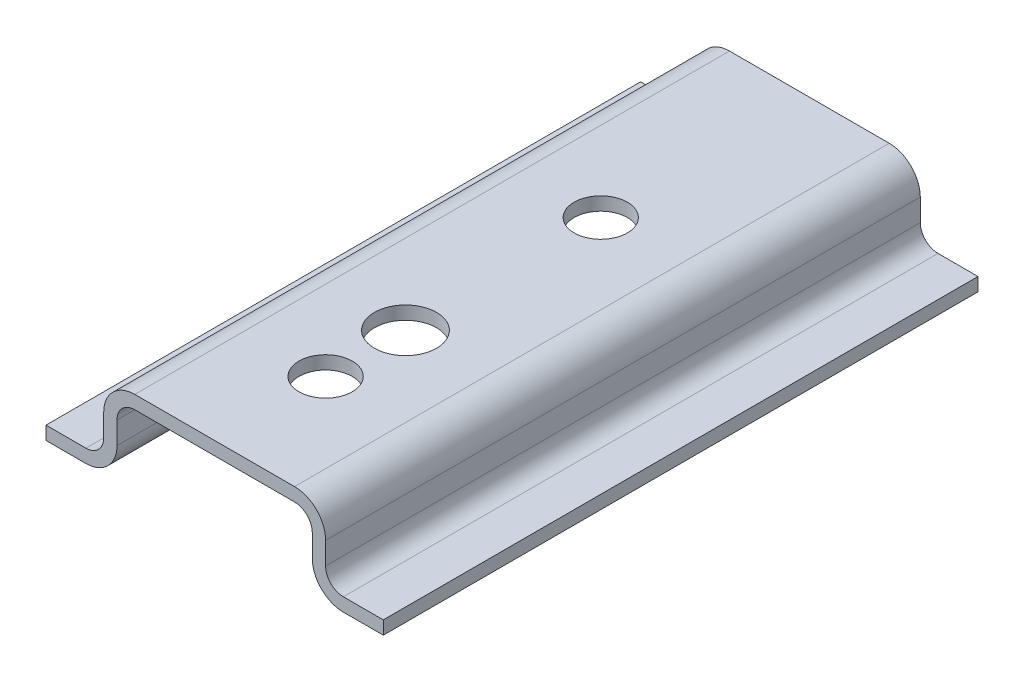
ISO-10303-21;
HEADER;
FILE_DESCRIPTION(('STEP AP214'),'2;1');
FILE_NAME('part.step','',(''),(''),'','','');
FILE_SCHEMA(('AUTOMOTIVE_DESIGN { 1 0 10303 214 1 1 1 1 }'));
ENDSEC;
DATA;
#1=APPLICATION_CONTEXT('core data for automotive mechanical design processes');
#2=APPLICATION_PROTOCOL_DEFINITION('international standard','automotive_design',2000,#1);
#3=PRODUCT_CONTEXT('',#1,'mechanical');
#4=PRODUCT('Part','Part','',(#3));
#5=PRODUCT_RELATED_PRODUCT_CATEGORY('part','',(#4));
#6=PRODUCT_DEFINITION_FORMATION('','',#4);
#7=PRODUCT_DEFINITION_CONTEXT('part definition',#1,'design');
#8=PRODUCT_DEFINITION('design','',#6,#7);
#9=PRODUCT_DEFINITION_SHAPE('','',#8);
#10=(LENGTH_UNIT() NAMED_UNIT(*) SI_UNIT(.MILLI.,.METRE.));
#11=(NAMED_UNIT(*) PLANE_ANGLE_UNIT() SI_UNIT($,.RADIAN.));
#12=(NAMED_UNIT(*) SI_UNIT($,.STERADIAN.) SOLID_ANGLE_UNIT());
#13=UNCERTAINTY_MEASURE_WITH_UNIT(LENGTH_MEASURE(1.E-05),#10,'distance_accuracy_value','');
#14=(GEOMETRIC_REPRESENTATION_CONTEXT(3) GLOBAL_UNCERTAINTY_ASSIGNED_CONTEXT((#13)) GLOBAL_UNIT_ASSIGNED_CONTEXT((#10,
#11,#12)) REPRESENTATION_CONTEXT('',''));
#15=CARTESIAN_POINT('',(0.,0.,0.));
#16=DIRECTION('',(0.,0.,1.));
#17=DIRECTION('',(1.,0.,0.));
#18=AXIS2_PLACEMENT_3D('',#15,#16,#17);
#19=CARTESIAN_POINT('',(-60.6550879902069,-32.7385166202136,134.));
#20=DIRECTION('',(0.,1.,0.));
#21=DIRECTION('',(0.,0.,1.));
#22=AXIS2_PLACEMENT_3D('',#19,#20,#21);
#23=PLANE('',#22);
#24=CARTESIAN_POINT('',(-42.6550879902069,-32.7385166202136,91.));
#25=DIRECTION('',(0.,1.,0.));
#26=DIRECTION('',(0.,0.,1.));
#27=AXIS2_PLACEMENT_3D('',#24,#25,#26);
#28=CIRCLE('',#27,7.);
#29=CARTESIAN_POINT('',(-42.6550879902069,-32.7385166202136,98.));
#30=VERTEX_POINT('',#29);
#31=EDGE_CURVE('E785',#30,#30,#28,.T.);
#32=ORIENTED_EDGE('',*,*,#31,.T.);
#33=EDGE_LOOP('',(#32));
#34=FACE_BOUND('',#33,.T.);
#35=CARTESIAN_POINT('',(-42.6550879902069,-32.7385166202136,109.));
#36=DIRECTION('',(0.,1.,0.));
#37=DIRECTION('',(0.,0.,1.));
#38=AXIS2_PLACEMENT_3D('',#35,#36,#37);
#39=CIRCLE('',#38,5.99999999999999);
#40=CARTESIAN_POINT('',(-42.6550879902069,-32.7385166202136,115.));
#41=VERTEX_POINT('',#40);
#42=EDGE_CURVE('E503',#41,#41,#39,.F.);
#43=ORIENTED_EDGE('',*,*,#42,.F.);
#44=EDGE_LOOP('',(#43));
#45=FACE_BOUND('',#44,.T.);
#46=DIRECTION('',(1.,0.,0.));
#47=VECTOR('',#46,1.);
#48=CARTESIAN_POINT('',(-60.6550879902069,-32.7385166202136,0.));
#49=LINE('',#48,#47);
#50=CARTESIAN_POINT('',(-60.6550879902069,-32.7385166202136,0.));
#51=VERTEX_POINT('',#50);
#52=CARTESIAN_POINT('',(-24.6550879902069,-32.7385166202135,0.));
#53=VERTEX_POINT('',#52);
#54=EDGE_CURVE('E515',#51,#53,#49,.T.);
#55=ORIENTED_EDGE('',*,*,#54,.T.);
#56=DIRECTION('',(0.,0.,-1.));
#57=VECTOR('',#56,1.);
#58=CARTESIAN_POINT('',(-24.6550879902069,-32.7385166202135,134.));
#59=LINE('',#58,#57);
#60=CARTESIAN_POINT('',(-24.6550879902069,-32.7385166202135,134.));
#61=VERTEX_POINT('',#60);
#62=EDGE_CURVE('E629',#61,#53,#59,.T.);
#63=ORIENTED_EDGE('',*,*,#62,.F.);
#64=DIRECTION('',(1.,0.,0.));
#65=VECTOR('',#64,1.);
#66=CARTESIAN_POINT('',(-60.6550879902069,-32.7385166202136,134.));
#67=LINE('',#66,#65);
#68=CARTESIAN_POINT('',(-60.6550879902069,-32.7385166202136,134.));
#69=VERTEX_POINT('',#68);
#70=EDGE_CURVE('E564',#69,#61,#67,.T.);
#71=ORIENTED_EDGE('',*,*,#70,.F.);
#72=DIRECTION('',(0.,0.,-1.));
#73=VECTOR('',#72,1.);
#74=CARTESIAN_POINT('',(-60.6550879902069,-32.7385166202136,134.));
#75=LINE('',#74,#73);
#76=EDGE_CURVE('E632',#69,#51,#75,.T.);
#77=ORIENTED_EDGE('',*,*,#76,.T.);
#78=EDGE_LOOP('',(#55,#63,#71,#77));
#79=FACE_BOUND('',#78,.T.);
#80=CARTESIAN_POINT('',(-42.6550879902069,-32.7385166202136,47.));
#81=DIRECTION('',(0.,1.,0.));
#82=DIRECTION('',(0.,0.,1.));
#83=AXIS2_PLACEMENT_3D('',#80,#81,#82);
#84=CIRCLE('',#83,5.99999999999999);
#85=CARTESIAN_POINT('',(-42.6550879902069,-32.7385166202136,53.));
#86=VERTEX_POINT('',#85);
#87=EDGE_CURVE('E789',#86,#86,#84,.F.);
#88=ORIENTED_EDGE('',*,*,#87,.F.);
#89=EDGE_LOOP('',(#88));
#90=FACE_BOUND('',#89,.T.);
#91=ADVANCED_FACE('F348',(#34,#45,#79,#90),#23,.F.);
#92=CARTESIAN_POINT('',(-60.6550879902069,-29.7385166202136,134.));
#93=DIRECTION('',(0.,1.,0.));
#94=DIRECTION('',(0.,0.,1.));
#95=AXIS2_PLACEMENT_3D('',#92,#93,#94);
#96=PLANE('',#95);
#97=CARTESIAN_POINT('',(-42.6550879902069,-29.7385166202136,91.));
#98=DIRECTION('',(0.,1.,0.));
#99=DIRECTION('',(0.,0.,1.));
#100=AXIS2_PLACEMENT_3D('',#97,#98,#99);
#101=CIRCLE('',#100,7.);
#102=CARTESIAN_POINT('',(-42.6550879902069,-29.7385166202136,98.));
#103=VERTEX_POINT('',#102);
#104=EDGE_CURVE('E783',#103,#103,#101,.T.);
#105=ORIENTED_EDGE('',*,*,#104,.F.);
#106=EDGE_LOOP('',(#105));
#107=FACE_BOUND('',#106,.T.);
#108=CARTESIAN_POINT('',(-42.6550879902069,-29.7385166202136,109.));
#109=DIRECTION('',(0.,1.,0.));
#110=DIRECTION('',(0.,0.,1.));
#111=AXIS2_PLACEMENT_3D('',#108,#109,#110);
#112=CIRCLE('',#111,5.99999999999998);
#113=CARTESIAN_POINT('',(-42.6550879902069,-29.7385166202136,115.));
#114=VERTEX_POINT('',#113);
#115=EDGE_CURVE('E506',#114,#114,#112,.T.);
#116=ORIENTED_EDGE('',*,*,#115,.F.);
#117=EDGE_LOOP('',(#116));
#118=FACE_BOUND('',#117,.T.);
#119=DIRECTION('',(1.,0.,0.));
#120=VECTOR('',#119,1.);
#121=CARTESIAN_POINT('',(-60.6550879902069,-29.7385166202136,0.));
#122=LINE('',#121,#120);
#123=CARTESIAN_POINT('',(-60.6550879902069,-29.7385166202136,0.));
#124=VERTEX_POINT('',#123);
#125=CARTESIAN_POINT('',(-24.6550879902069,-29.7385166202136,0.));
#126=VERTEX_POINT('',#125);
#127=EDGE_CURVE('E541',#124,#126,#122,.T.);
#128=ORIENTED_EDGE('',*,*,#127,.F.);
#129=DIRECTION('',(0.,0.,-1.));
#130=VECTOR('',#129,1.);
#131=CARTESIAN_POINT('',(-60.6550879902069,-29.7385166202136,134.));
#132=LINE('',#131,#130);
#133=CARTESIAN_POINT('',(-60.6550879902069,-29.7385166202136,134.));
#134=VERTEX_POINT('',#133);
#135=EDGE_CURVE('E606',#134,#124,#132,.T.);
#136=ORIENTED_EDGE('',*,*,#135,.F.);
#137=DIRECTION('',(1.,0.,0.));
#138=VECTOR('',#137,1.);
#139=CARTESIAN_POINT('',(-60.6550879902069,-29.7385166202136,134.));
#140=LINE('',#139,#138);
#141=CARTESIAN_POINT('',(-24.6550879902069,-29.7385166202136,134.));
#142=VERTEX_POINT('',#141);
#143=EDGE_CURVE('E587',#134,#142,#140,.T.);
#144=ORIENTED_EDGE('',*,*,#143,.T.);
#145=DIRECTION('',(0.,0.,-1.));
#146=VECTOR('',#145,1.);
#147=CARTESIAN_POINT('',(-24.6550879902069,-29.7385166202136,134.));
#148=LINE('',#147,#146);
#149=EDGE_CURVE('E608',#142,#126,#148,.T.);
#150=ORIENTED_EDGE('',*,*,#149,.T.);
#151=EDGE_LOOP('',(#128,#136,#144,#150));
#152=FACE_BOUND('',#151,.T.);
#153=CARTESIAN_POINT('',(-42.6550879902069,-29.7385166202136,47.));
#154=DIRECTION('',(0.,1.,0.));
#155=DIRECTION('',(0.,0.,1.));
#156=AXIS2_PLACEMENT_3D('',#153,#154,#155);
#157=CIRCLE('',#156,5.99999999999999);
#158=CARTESIAN_POINT('',(-42.6550879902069,-29.7385166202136,53.));
#159=VERTEX_POINT('',#158);
#160=EDGE_CURVE('E786',#159,#159,#157,.T.);
#161=ORIENTED_EDGE('',*,*,#160,.F.);
#162=EDGE_LOOP('',(#161));
#163=FACE_BOUND('',#162,.T.);
#164=ADVANCED_FACE('F662',(#107,#118,#152,#163),#96,.T.);
#165=CARTESIAN_POINT('',(-80.6550879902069,-45.7385166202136,134.));
#166=DIRECTION('',(1.,0.,0.));
#167=DIRECTION('',(0.,0.,-1.));
#168=AXIS2_PLACEMENT_3D('',#165,#166,#167);
#169=PLANE('',#168);
#170=DIRECTION('',(0.,-1.,0.));
#171=VECTOR('',#170,1.);
#172=CARTESIAN_POINT('',(-80.6550879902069,-45.7385166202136,0.));
#173=LINE('',#172,#171);
#174=CARTESIAN_POINT('',(-80.6550879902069,-45.7385166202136,0.));
#175=VERTEX_POINT('',#174);
#176=CARTESIAN_POINT('',(-80.6550879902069,-48.7385166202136,0.));
#177=VERTEX_POINT('',#176);
#178=EDGE_CURVE('E491',#175,#177,#173,.T.);
#179=ORIENTED_EDGE('',*,*,#178,.T.);
#180=DIRECTION('',(0.,0.,-1.));
#181=VECTOR('',#180,1.);
#182=CARTESIAN_POINT('',(-80.6550879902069,-48.7385166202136,134.));
#183=LINE('',#182,#181);
#184=CARTESIAN_POINT('',(-80.6550879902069,-48.7385166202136,134.));
#185=VERTEX_POINT('',#184);
#186=EDGE_CURVE('E11',#185,#177,#183,.T.);
#187=ORIENTED_EDGE('',*,*,#186,.F.);
#188=DIRECTION('',(0.,-1.,0.));
#189=VECTOR('',#188,1.);
#190=CARTESIAN_POINT('',(-80.6550879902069,-45.7385166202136,134.));
#191=LINE('',#190,#189);
#192=CARTESIAN_POINT('',(-80.6550879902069,-45.7385166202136,134.));
#193=VERTEX_POINT('',#192);
#194=EDGE_CURVE('E555',#193,#185,#191,.T.);
#195=ORIENTED_EDGE('',*,*,#194,.F.);
#196=DIRECTION('',(0.,0.,-1.));
#197=VECTOR('',#196,1.);
#198=CARTESIAN_POINT('',(-80.6550879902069,-45.7385166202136,134.));
#199=LINE('',#198,#197);
#200=EDGE_CURVE('E363',#193,#175,#199,.T.);
#201=ORIENTED_EDGE('',*,*,#200,.T.);
#202=EDGE_LOOP('',(#179,#187,#195,#201));
#203=FACE_BOUND('',#202,.T.);
#204=ADVANCED_FACE('F350',(#203),#169,.F.);
#205=CARTESIAN_POINT('',(-80.6550879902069,-48.7385166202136,134.));
#206=DIRECTION('',(0.,1.,0.));
#207=DIRECTION('',(0.,0.,1.));
#208=AXIS2_PLACEMENT_3D('',#205,#206,#207);
#209=PLANE('',#208);
#210=DIRECTION('',(1.,0.,0.));
#211=VECTOR('',#210,1.);
#212=CARTESIAN_POINT('',(-80.6550879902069,-48.7385166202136,0.));
#213=LINE('',#212,#211);
#214=CARTESIAN_POINT('',(-71.6550879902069,-48.7385166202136,0.));
#215=VERTEX_POINT('',#214);
#216=EDGE_CURVE('E487',#177,#215,#213,.T.);
#217=ORIENTED_EDGE('',*,*,#216,.T.);
#218=DIRECTION('',(0.,0.,-1.));
#219=VECTOR('',#218,1.);
#220=CARTESIAN_POINT('',(-71.6550879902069,-48.7385166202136,134.));
#221=LINE('',#220,#219);
#222=CARTESIAN_POINT('',(-71.6550879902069,-48.7385166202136,134.));
#223=VERTEX_POINT('',#222);
#224=EDGE_CURVE('E356',#223,#215,#221,.T.);
#225=ORIENTED_EDGE('',*,*,#224,.F.);
#226=DIRECTION('',(1.,0.,0.));
#227=VECTOR('',#226,1.);
#228=CARTESIAN_POINT('',(-80.6550879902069,-48.7385166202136,134.));
#229=LINE('',#228,#227);
#230=EDGE_CURVE('E500',#185,#223,#229,.T.);
#231=ORIENTED_EDGE('',*,*,#230,.F.);
#232=ORIENTED_EDGE('',*,*,#186,.T.);
#233=EDGE_LOOP('',(#217,#225,#231,#232));
#234=FACE_BOUND('',#233,.T.);
#235=ADVANCED_FACE('F499',(#234),#209,.F.);
#236=CARTESIAN_POINT('',(-71.6550879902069,-41.7385166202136,134.));
#237=DIRECTION('',(0.,0.,-1.));
#238=DIRECTION('',(-1.,0.,0.));
#239=AXIS2_PLACEMENT_3D('',#236,#237,#238);
#240=CYLINDRICAL_SURFACE('',#239,6.99999999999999);
#241=CARTESIAN_POINT('',(-71.6550879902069,-41.7385166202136,0.));
#242=DIRECTION('',(0.,0.,1.));
#243=DIRECTION('',(1.,0.,0.));
#244=AXIS2_PLACEMENT_3D('',#241,#242,#243);
#245=CIRCLE('',#244,6.99999999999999);
#246=CARTESIAN_POINT('',(-64.6550879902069,-41.7385166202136,0.));
#247=VERTEX_POINT('',#246);
#248=EDGE_CURVE('E493',#215,#247,#245,.T.);
#249=ORIENTED_EDGE('',*,*,#248,.T.);
#250=DIRECTION('',(0.,0.,-1.));
#251=VECTOR('',#250,1.);
#252=CARTESIAN_POINT('',(-64.6550879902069,-41.7385166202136,134.));
#253=LINE('',#252,#251);
#254=CARTESIAN_POINT('',(-64.6550879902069,-41.7385166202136,134.));
#255=VERTEX_POINT('',#254);
#256=EDGE_CURVE('E638',#255,#247,#253,.T.);
#257=ORIENTED_EDGE('',*,*,#256,.F.);
#258=CARTESIAN_POINT('',(-71.6550879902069,-41.7385166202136,134.));
#259=DIRECTION('',(0.,0.,1.));
#260=DIRECTION('',(1.,0.,0.));
#261=AXIS2_PLACEMENT_3D('',#258,#259,#260);
#262=CIRCLE('',#261,6.99999999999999);
#263=EDGE_CURVE('E558',#223,#255,#262,.T.);
#264=ORIENTED_EDGE('',*,*,#263,.F.);
#265=ORIENTED_EDGE('',*,*,#224,.T.);
#266=EDGE_LOOP('',(#249,#257,#264,#265));
#267=FACE_BOUND('',#266,.T.);
#268=ADVANCED_FACE('F642',(#267),#240,.T.);
#269=CARTESIAN_POINT('',(-64.6550879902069,-41.7385166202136,134.));
#270=DIRECTION('',(-1.,0.,0.));
#271=DIRECTION('',(0.,0.,1.));
#272=AXIS2_PLACEMENT_3D('',#269,#270,#271);
#273=PLANE('',#272);
#274=DIRECTION('',(0.,1.,0.));
#275=VECTOR('',#274,1.);
#276=CARTESIAN_POINT('',(-64.6550879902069,-41.7385166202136,0.));
#277=LINE('',#276,#275);
#278=CARTESIAN_POINT('',(-64.6550879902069,-36.7385166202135,0.));
#279=VERTEX_POINT('',#278);
#280=EDGE_CURVE('E511',#247,#279,#277,.T.);
#281=ORIENTED_EDGE('',*,*,#280,.T.);
#282=DIRECTION('',(0.,0.,-1.));
#283=VECTOR('',#282,1.);
#284=CARTESIAN_POINT('',(-64.6550879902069,-36.7385166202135,134.));
#285=LINE('',#284,#283);
#286=CARTESIAN_POINT('',(-64.6550879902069,-36.7385166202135,134.));
#287=VERTEX_POINT('',#286);
#288=EDGE_CURVE('E635',#287,#279,#285,.T.);
#289=ORIENTED_EDGE('',*,*,#288,.F.);
#290=DIRECTION('',(0.,1.,0.));
#291=VECTOR('',#290,1.);
#292=CARTESIAN_POINT('',(-64.6550879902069,-41.7385166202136,134.));
#293=LINE('',#292,#291);
#294=EDGE_CURVE('E560',#255,#287,#293,.T.);
#295=ORIENTED_EDGE('',*,*,#294,.F.);
#296=ORIENTED_EDGE('',*,*,#256,.T.);
#297=EDGE_LOOP('',(#281,#289,#295,#296));
#298=FACE_BOUND('',#297,.T.);
#299=ADVANCED_FACE('F716',(#298),#273,.F.);
#300=CARTESIAN_POINT('',(-60.6550879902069,-36.7385166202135,134.));
#301=DIRECTION('',(0.,0.,-1.));
#302=DIRECTION('',(-1.,0.,0.));
#303=AXIS2_PLACEMENT_3D('',#300,#301,#302);
#304=CYLINDRICAL_SURFACE('',#303,3.99999999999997);
#305=CARTESIAN_POINT('',(-60.6550879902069,-36.7385166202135,0.));
#306=DIRECTION('',(0.,0.,-1.));
#307=DIRECTION('',(-1.,0.,0.));
#308=AXIS2_PLACEMENT_3D('',#305,#306,#307);
#309=CIRCLE('',#308,3.99999999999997);
#310=EDGE_CURVE('E513',#279,#51,#309,.T.);
#311=ORIENTED_EDGE('',*,*,#310,.T.);
#312=ORIENTED_EDGE('',*,*,#76,.F.);
#313=CARTESIAN_POINT('',(-60.6550879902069,-36.7385166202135,134.));
#314=DIRECTION('',(0.,0.,-1.));
#315=DIRECTION('',(-1.,0.,0.));
#316=AXIS2_PLACEMENT_3D('',#313,#314,#315);
#317=CIRCLE('',#316,3.99999999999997);
#318=EDGE_CURVE('E562',#287,#69,#317,.T.);
#319=ORIENTED_EDGE('',*,*,#318,.F.);
#320=ORIENTED_EDGE('',*,*,#288,.T.);
#321=EDGE_LOOP('',(#311,#312,#319,#320));
#322=FACE_BOUND('',#321,.T.);
#323=ADVANCED_FACE('F714',(#322),#304,.F.);
#324=CARTESIAN_POINT('',(-24.6550879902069,-36.7385166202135,134.));
#325=DIRECTION('',(0.,0.,-1.));
#326=DIRECTION('',(-1.,0.,0.));
#327=AXIS2_PLACEMENT_3D('',#324,#325,#326);
#328=CYLINDRICAL_SURFACE('',#327,3.99999999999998);
#329=CARTESIAN_POINT('',(-24.6550879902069,-36.7385166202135,0.));
#330=DIRECTION('',(0.,0.,-1.));
#331=DIRECTION('',(-1.,0.,0.));
#332=AXIS2_PLACEMENT_3D('',#329,#330,#331);
#333=CIRCLE('',#332,3.99999999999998);
#334=CARTESIAN_POINT('',(-20.6550879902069,-36.7385166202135,0.));
#335=VERTEX_POINT('',#334);
#336=EDGE_CURVE('E517',#53,#335,#333,.T.);
#337=ORIENTED_EDGE('',*,*,#336,.T.);
#338=DIRECTION('',(0.,0.,-1.));
#339=VECTOR('',#338,1.);
#340=CARTESIAN_POINT('',(-20.6550879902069,-36.7385166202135,134.));
#341=LINE('',#340,#339);
#342=CARTESIAN_POINT('',(-20.6550879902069,-36.7385166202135,134.));
#343=VERTEX_POINT('',#342);
#344=EDGE_CURVE('E626',#343,#335,#341,.T.);
#345=ORIENTED_EDGE('',*,*,#344,.F.);
#346=CARTESIAN_POINT('',(-24.6550879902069,-36.7385166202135,134.));
#347=DIRECTION('',(0.,0.,-1.));
#348=DIRECTION('',(-1.,0.,0.));
#349=AXIS2_PLACEMENT_3D('',#346,#347,#348);
#350=CIRCLE('',#349,3.99999999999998);
#351=EDGE_CURVE('E566',#61,#343,#350,.T.);
#352=ORIENTED_EDGE('',*,*,#351,.F.);
#353=ORIENTED_EDGE('',*,*,#62,.T.);
#354=EDGE_LOOP('',(#337,#345,#352,#353));
#355=FACE_BOUND('',#354,.T.);
#356=ADVANCED_FACE('F705',(#355),#328,.F.);
#357=CARTESIAN_POINT('',(-20.6550879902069,-36.7385166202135,134.));
#358=DIRECTION('',(1.,0.,0.));
#359=DIRECTION('',(0.,0.,-1.));
#360=AXIS2_PLACEMENT_3D('',#357,#358,#359);
#361=PLANE('',#360);
#362=DIRECTION('',(0.,-1.,0.));
#363=VECTOR('',#362,1.);
#364=CARTESIAN_POINT('',(-20.6550879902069,-36.7385166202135,0.));
#365=LINE('',#364,#363);
#366=CARTESIAN_POINT('',(-20.6550879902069,-41.7385166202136,0.));
#367=VERTEX_POINT('',#366);
#368=EDGE_CURVE('E519',#335,#367,#365,.T.);
#369=ORIENTED_EDGE('',*,*,#368,.T.);
#370=DIRECTION('',(0.,0.,-1.));
#371=VECTOR('',#370,1.);
#372=CARTESIAN_POINT('',(-20.6550879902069,-41.7385166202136,134.));
#373=LINE('',#372,#371);
#374=CARTESIAN_POINT('',(-20.6550879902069,-41.7385166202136,134.));
#375=VERTEX_POINT('',#374);
#376=EDGE_CURVE('E623',#375,#367,#373,.T.);
#377=ORIENTED_EDGE('',*,*,#376,.F.);
#378=DIRECTION('',(0.,-1.,0.));
#379=VECTOR('',#378,1.);
#380=CARTESIAN_POINT('',(-20.6550879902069,-36.7385166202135,134.));
#381=LINE('',#380,#379);
#382=EDGE_CURVE('E568',#343,#375,#381,.T.);
#383=ORIENTED_EDGE('',*,*,#382,.F.);
#384=ORIENTED_EDGE('',*,*,#344,.T.);
#385=EDGE_LOOP('',(#369,#377,#383,#384));
#386=FACE_BOUND('',#385,.T.);
#387=ADVANCED_FACE('F699',(#386),#361,.F.);
#388=CARTESIAN_POINT('',(-13.6550879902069,-41.7385166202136,134.));
#389=DIRECTION('',(0.,0.,-1.));
#390=DIRECTION('',(-1.,0.,0.));
#391=AXIS2_PLACEMENT_3D('',#388,#389,#390);
#392=CYLINDRICAL_SURFACE('',#391,7.00000000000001);
#393=CARTESIAN_POINT('',(-13.6550879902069,-41.7385166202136,0.));
#394=DIRECTION('',(0.,0.,1.));
#395=DIRECTION('',(1.,0.,0.));
#396=AXIS2_PLACEMENT_3D('',#393,#394,#395);
#397=CIRCLE('',#396,7.00000000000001);
#398=CARTESIAN_POINT('',(-13.6550879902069,-48.7385166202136,0.));
#399=VERTEX_POINT('',#398);
#400=EDGE_CURVE('E521',#367,#399,#397,.T.);
#401=ORIENTED_EDGE('',*,*,#400,.T.);
#402=DIRECTION('',(0.,0.,-1.));
#403=VECTOR('',#402,1.);
#404=CARTESIAN_POINT('',(-13.6550879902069,-48.7385166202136,134.));
#405=LINE('',#404,#403);
#406=CARTESIAN_POINT('',(-13.6550879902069,-48.7385166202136,134.));
#407=VERTEX_POINT('',#406);
#408=EDGE_CURVE('E620',#407,#399,#405,.T.);
#409=ORIENTED_EDGE('',*,*,#408,.F.);
#410=CARTESIAN_POINT('',(-13.6550879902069,-41.7385166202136,134.));
#411=DIRECTION('',(0.,0.,1.));
#412=DIRECTION('',(1.,0.,0.));
#413=AXIS2_PLACEMENT_3D('',#410,#411,#412);
#414=CIRCLE('',#413,7.00000000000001);
#415=EDGE_CURVE('E570',#375,#407,#414,.T.);
#416=ORIENTED_EDGE('',*,*,#415,.F.);
#417=ORIENTED_EDGE('',*,*,#376,.T.);
#418=EDGE_LOOP('',(#401,#409,#416,#417));
#419=FACE_BOUND('',#418,.T.);
#420=ADVANCED_FACE('F695',(#419),#392,.T.);
#421=CARTESIAN_POINT('',(-13.6550879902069,-48.7385166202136,134.));
#422=DIRECTION('',(0.,1.,0.));
#423=DIRECTION('',(0.,0.,1.));
#424=AXIS2_PLACEMENT_3D('',#421,#422,#423);
#425=PLANE('',#424);
#426=DIRECTION('',(1.,0.,0.));
#427=VECTOR('',#426,1.);
#428=CARTESIAN_POINT('',(-13.6550879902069,-48.7385166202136,0.));
#429=LINE('',#428,#427);
#430=CARTESIAN_POINT('',(-4.6550879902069,-48.7385166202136,0.));
#431=VERTEX_POINT('',#430);
#432=EDGE_CURVE('E523',#399,#431,#429,.T.);
#433=ORIENTED_EDGE('',*,*,#432,.T.);
#434=DIRECTION('',(0.,0.,-1.));
#435=VECTOR('',#434,1.);
#436=CARTESIAN_POINT('',(-4.6550879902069,-48.7385166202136,134.));
#437=LINE('',#436,#435);
#438=CARTESIAN_POINT('',(-4.6550879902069,-48.7385166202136,134.));
#439=VERTEX_POINT('',#438);
#440=EDGE_CURVE('E618',#439,#431,#437,.T.);
#441=ORIENTED_EDGE('',*,*,#440,.F.);
#442=DIRECTION('',(1.,0.,0.));
#443=VECTOR('',#442,1.);
#444=CARTESIAN_POINT('',(-13.6550879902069,-48.7385166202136,134.));
#445=LINE('',#444,#443);
#446=EDGE_CURVE('E572',#407,#439,#445,.T.);
#447=ORIENTED_EDGE('',*,*,#446,.F.);
#448=ORIENTED_EDGE('',*,*,#408,.T.);
#449=EDGE_LOOP('',(#433,#441,#447,#448));
#450=FACE_BOUND('',#449,.T.);
#451=ADVANCED_FACE('F690',(#450),#425,.F.);
#452=CARTESIAN_POINT('',(-4.6550879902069,-45.7385166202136,134.));
#453=DIRECTION('',(1.,0.,0.));
#454=DIRECTION('',(0.,0.,-1.));
#455=AXIS2_PLACEMENT_3D('',#452,#453,#454);
#456=PLANE('',#455);
#457=DIRECTION('',(0.,-1.,0.));
#458=VECTOR('',#457,1.);
#459=CARTESIAN_POINT('',(-4.6550879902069,-45.7385166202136,0.));
#460=LINE('',#459,#458);
#461=CARTESIAN_POINT('',(-4.6550879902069,-45.7385166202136,0.));
#462=VERTEX_POINT('',#461);
#463=EDGE_CURVE('E526',#462,#431,#460,.T.);
#464=ORIENTED_EDGE('',*,*,#463,.F.);
#465=DIRECTION('',(0.,0.,-1.));
#466=VECTOR('',#465,1.);
#467=CARTESIAN_POINT('',(-4.6550879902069,-45.7385166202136,134.));
#468=LINE('',#467,#466);
#469=CARTESIAN_POINT('',(-4.6550879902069,-45.7385166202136,134.));
#470=VERTEX_POINT('',#469);
#471=EDGE_CURVE('E616',#470,#462,#468,.T.);
#472=ORIENTED_EDGE('',*,*,#471,.F.);
#473=DIRECTION('',(0.,-1.,0.));
#474=VECTOR('',#473,1.);
#475=CARTESIAN_POINT('',(-4.6550879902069,-45.7385166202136,134.));
#476=LINE('',#475,#474);
#477=EDGE_CURVE('E574',#470,#439,#476,.T.);
#478=ORIENTED_EDGE('',*,*,#477,.T.);
#479=ORIENTED_EDGE('',*,*,#440,.T.);
#480=EDGE_LOOP('',(#464,#472,#478,#479));
#481=FACE_BOUND('',#480,.T.);
#482=ADVANCED_FACE('F684',(#481),#456,.T.);
#483=CARTESIAN_POINT('',(-13.6550879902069,-45.7385166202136,134.));
#484=DIRECTION('',(0.,1.,0.));
#485=DIRECTION('',(0.,0.,1.));
#486=AXIS2_PLACEMENT_3D('',#483,#484,#485);
#487=PLANE('',#486);
#488=DIRECTION('',(1.,0.,0.));
#489=VECTOR('',#488,1.);
#490=CARTESIAN_POINT('',(-13.6550879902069,-45.7385166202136,0.));
#491=LINE('',#490,#489);
#492=CARTESIAN_POINT('',(-13.6550879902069,-45.7385166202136,0.));
#493=VERTEX_POINT('',#492);
#494=EDGE_CURVE('E529',#493,#462,#491,.T.);
#495=ORIENTED_EDGE('',*,*,#494,.F.);
#496=DIRECTION('',(0.,0.,-1.));
#497=VECTOR('',#496,1.);
#498=CARTESIAN_POINT('',(-13.6550879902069,-45.7385166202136,134.));
#499=LINE('',#498,#497);
#500=CARTESIAN_POINT('',(-13.6550879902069,-45.7385166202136,134.));
#501=VERTEX_POINT('',#500);
#502=EDGE_CURVE('E614',#501,#493,#499,.T.);
#503=ORIENTED_EDGE('',*,*,#502,.F.);
#504=DIRECTION('',(1.,0.,0.));
#505=VECTOR('',#504,1.);
#506=CARTESIAN_POINT('',(-13.6550879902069,-45.7385166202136,134.));
#507=LINE('',#506,#505);
#508=EDGE_CURVE('E577',#501,#470,#507,.T.);
#509=ORIENTED_EDGE('',*,*,#508,.T.);
#510=ORIENTED_EDGE('',*,*,#471,.T.);
#511=EDGE_LOOP('',(#495,#503,#509,#510));
#512=FACE_BOUND('',#511,.T.);
#513=ADVANCED_FACE('F679',(#512),#487,.T.);
#514=CARTESIAN_POINT('',(-13.6550879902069,-41.7385166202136,134.));
#515=DIRECTION('',(0.,0.,-1.));
#516=DIRECTION('',(-1.,0.,0.));
#517=AXIS2_PLACEMENT_3D('',#514,#515,#516);
#518=CYLINDRICAL_SURFACE('',#517,4.);
#519=CARTESIAN_POINT('',(-13.6550879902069,-41.7385166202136,0.));
#520=DIRECTION('',(0.,0.,-1.));
#521=DIRECTION('',(-1.,0.,0.));
#522=AXIS2_PLACEMENT_3D('',#519,#520,#521);
#523=CIRCLE('',#522,4.);
#524=CARTESIAN_POINT('',(-17.6550879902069,-41.7385166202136,0.));
#525=VERTEX_POINT('',#524);
#526=EDGE_CURVE('E532',#493,#525,#523,.T.);
#527=ORIENTED_EDGE('',*,*,#526,.T.);
#528=DIRECTION('',(0.,0.,-1.));
#529=VECTOR('',#528,1.);
#530=CARTESIAN_POINT('',(-17.6550879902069,-41.7385166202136,134.));
#531=LINE('',#530,#529);
#532=CARTESIAN_POINT('',(-17.6550879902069,-41.7385166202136,134.));
#533=VERTEX_POINT('',#532);
#534=EDGE_CURVE('E612',#533,#525,#531,.T.);
#535=ORIENTED_EDGE('',*,*,#534,.F.);
#536=CARTESIAN_POINT('',(-13.6550879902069,-41.7385166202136,134.));
#537=DIRECTION('',(0.,0.,-1.));
#538=DIRECTION('',(-1.,0.,0.));
#539=AXIS2_PLACEMENT_3D('',#536,#537,#538);
#540=CIRCLE('',#539,4.);
#541=EDGE_CURVE('E580',#501,#533,#540,.T.);
#542=ORIENTED_EDGE('',*,*,#541,.F.);
#543=ORIENTED_EDGE('',*,*,#502,.T.);
#544=EDGE_LOOP('',(#527,#535,#542,#543));
#545=FACE_BOUND('',#544,.T.);
#546=ADVANCED_FACE('F676',(#545),#518,.F.);
#547=CARTESIAN_POINT('',(-17.6550879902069,-36.7385166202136,134.));
#548=DIRECTION('',(1.,0.,0.));
#549=DIRECTION('',(0.,0.,-1.));
#550=AXIS2_PLACEMENT_3D('',#547,#548,#549);
#551=PLANE('',#550);
#552=DIRECTION('',(0.,-1.,0.));
#553=VECTOR('',#552,1.);
#554=CARTESIAN_POINT('',(-17.6550879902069,-36.7385166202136,0.));
#555=LINE('',#554,#553);
#556=CARTESIAN_POINT('',(-17.6550879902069,-36.7385166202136,0.));
#557=VERTEX_POINT('',#556);
#558=EDGE_CURVE('E535',#557,#525,#555,.T.);
#559=ORIENTED_EDGE('',*,*,#558,.F.);
#560=DIRECTION('',(0.,0.,-1.));
#561=VECTOR('',#560,1.);
#562=CARTESIAN_POINT('',(-17.6550879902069,-36.7385166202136,134.));
#563=LINE('',#562,#561);
#564=CARTESIAN_POINT('',(-17.6550879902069,-36.7385166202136,134.));
#565=VERTEX_POINT('',#564);
#566=EDGE_CURVE('E610',#565,#557,#563,.T.);
#567=ORIENTED_EDGE('',*,*,#566,.F.);
#568=DIRECTION('',(0.,-1.,0.));
#569=VECTOR('',#568,1.);
#570=CARTESIAN_POINT('',(-17.6550879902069,-36.7385166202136,134.));
#571=LINE('',#570,#569);
#572=EDGE_CURVE('E582',#565,#533,#571,.T.);
#573=ORIENTED_EDGE('',*,*,#572,.T.);
#574=ORIENTED_EDGE('',*,*,#534,.T.);
#575=EDGE_LOOP('',(#559,#567,#573,#574));
#576=FACE_BOUND('',#575,.T.);
#577=ADVANCED_FACE('F670',(#576),#551,.T.);
#578=CARTESIAN_POINT('',(-24.6550879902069,-36.7385166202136,134.));
#579=DIRECTION('',(0.,0.,-1.));
#580=DIRECTION('',(-1.,0.,0.));
#581=AXIS2_PLACEMENT_3D('',#578,#579,#580);
#582=CYLINDRICAL_SURFACE('',#581,7.);
#583=CARTESIAN_POINT('',(-24.6550879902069,-36.7385166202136,0.));
#584=DIRECTION('',(0.,0.,1.));
#585=DIRECTION('',(1.,0.,0.));
#586=AXIS2_PLACEMENT_3D('',#583,#584,#585);
#587=CIRCLE('',#586,7.);
#588=EDGE_CURVE('E538',#557,#126,#587,.T.);
#589=ORIENTED_EDGE('',*,*,#588,.T.);
#590=ORIENTED_EDGE('',*,*,#149,.F.);
#591=CARTESIAN_POINT('',(-24.6550879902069,-36.7385166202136,134.));
#592=DIRECTION('',(0.,0.,1.));
#593=DIRECTION('',(1.,0.,0.));
#594=AXIS2_PLACEMENT_3D('',#591,#592,#593);
#595=CIRCLE('',#594,7.);
#596=EDGE_CURVE('E585',#565,#142,#595,.T.);
#597=ORIENTED_EDGE('',*,*,#596,.F.);
#598=ORIENTED_EDGE('',*,*,#566,.T.);
#599=EDGE_LOOP('',(#589,#590,#597,#598));
#600=FACE_BOUND('',#599,.T.);
#601=ADVANCED_FACE('F753',(#600),#582,.T.);
#602=CARTESIAN_POINT('',(-60.6550879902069,-36.7385166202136,134.));
#603=DIRECTION('',(0.,0.,-1.));
#604=DIRECTION('',(-1.,0.,0.));
#605=AXIS2_PLACEMENT_3D('',#602,#603,#604);
#606=CYLINDRICAL_SURFACE('',#605,7.);
#607=CARTESIAN_POINT('',(-60.6550879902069,-36.7385166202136,0.));
#608=DIRECTION('',(0.,0.,-1.));
#609=DIRECTION('',(-1.,0.,0.));
#610=AXIS2_PLACEMENT_3D('',#607,#608,#609);
#611=CIRCLE('',#610,7.);
#612=CARTESIAN_POINT('',(-67.6550879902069,-36.7385166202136,0.));
#613=VERTEX_POINT('',#612);
#614=EDGE_CURVE('E544',#613,#124,#611,.T.);
#615=ORIENTED_EDGE('',*,*,#614,.F.);
#616=DIRECTION('',(0.,0.,-1.));
#617=VECTOR('',#616,1.);
#618=CARTESIAN_POINT('',(-67.6550879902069,-36.7385166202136,134.));
#619=LINE('',#618,#617);
#620=CARTESIAN_POINT('',(-67.6550879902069,-36.7385166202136,134.));
#621=VERTEX_POINT('',#620);
#622=EDGE_CURVE('E604',#621,#613,#619,.T.);
#623=ORIENTED_EDGE('',*,*,#622,.F.);
#624=CARTESIAN_POINT('',(-60.6550879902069,-36.7385166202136,134.));
#625=DIRECTION('',(0.,0.,-1.));
#626=DIRECTION('',(-1.,0.,0.));
#627=AXIS2_PLACEMENT_3D('',#624,#625,#626);
#628=CIRCLE('',#627,7.);
#629=EDGE_CURVE('E590',#621,#134,#628,.T.);
#630=ORIENTED_EDGE('',*,*,#629,.T.);
#631=ORIENTED_EDGE('',*,*,#135,.T.);
#632=EDGE_LOOP('',(#615,#623,#630,#631));
#633=FACE_BOUND('',#632,.T.);
#634=ADVANCED_FACE('F658',(#633),#606,.T.);
#635=CARTESIAN_POINT('',(-67.6550879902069,-41.7385166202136,134.));
#636=DIRECTION('',(-1.,0.,0.));
#637=DIRECTION('',(0.,0.,1.));
#638=AXIS2_PLACEMENT_3D('',#635,#636,#637);
#639=PLANE('',#638);
#640=DIRECTION('',(0.,1.,0.));
#641=VECTOR('',#640,1.);
#642=CARTESIAN_POINT('',(-67.6550879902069,-41.7385166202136,0.));
#643=LINE('',#642,#641);
#644=CARTESIAN_POINT('',(-67.6550879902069,-41.7385166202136,0.));
#645=VERTEX_POINT('',#644);
#646=EDGE_CURVE('E547',#645,#613,#643,.T.);
#647=ORIENTED_EDGE('',*,*,#646,.F.);
#648=DIRECTION('',(0.,0.,-1.));
#649=VECTOR('',#648,1.);
#650=CARTESIAN_POINT('',(-67.6550879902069,-41.7385166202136,134.));
#651=LINE('',#650,#649);
#652=CARTESIAN_POINT('',(-67.6550879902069,-41.7385166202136,134.));
#653=VERTEX_POINT('',#652);
#654=EDGE_CURVE('E602',#653,#645,#651,.T.);
#655=ORIENTED_EDGE('',*,*,#654,.F.);
#656=DIRECTION('',(0.,1.,0.));
#657=VECTOR('',#656,1.);
#658=CARTESIAN_POINT('',(-67.6550879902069,-41.7385166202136,134.));
#659=LINE('',#658,#657);
#660=EDGE_CURVE('E593',#653,#621,#659,.T.);
#661=ORIENTED_EDGE('',*,*,#660,.T.);
#662=ORIENTED_EDGE('',*,*,#622,.T.);
#663=EDGE_LOOP('',(#647,#655,#661,#662));
#664=FACE_BOUND('',#663,.T.);
#665=ADVANCED_FACE('F655',(#664),#639,.T.);
#666=CARTESIAN_POINT('',(-71.6550879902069,-41.7385166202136,134.));
#667=DIRECTION('',(0.,0.,-1.));
#668=DIRECTION('',(-1.,0.,0.));
#669=AXIS2_PLACEMENT_3D('',#666,#667,#668);
#670=CYLINDRICAL_SURFACE('',#669,4.);
#671=CARTESIAN_POINT('',(-71.6550879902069,-41.7385166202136,0.));
#672=DIRECTION('',(0.,0.,1.));
#673=DIRECTION('',(1.,0.,0.));
#674=AXIS2_PLACEMENT_3D('',#671,#672,#673);
#675=CIRCLE('',#674,4.);
#676=CARTESIAN_POINT('',(-71.6550879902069,-45.7385166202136,0.));
#677=VERTEX_POINT('',#676);
#678=EDGE_CURVE('E550',#677,#645,#675,.T.);
#679=ORIENTED_EDGE('',*,*,#678,.F.);
#680=DIRECTION('',(0.,0.,-1.));
#681=VECTOR('',#680,1.);
#682=CARTESIAN_POINT('',(-71.6550879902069,-45.7385166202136,134.));
#683=LINE('',#682,#681);
#684=CARTESIAN_POINT('',(-71.6550879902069,-45.7385166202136,134.));
#685=VERTEX_POINT('',#684);
#686=EDGE_CURVE('E371',#685,#677,#683,.T.);
#687=ORIENTED_EDGE('',*,*,#686,.F.);
#688=CARTESIAN_POINT('',(-71.6550879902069,-41.7385166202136,134.));
#689=DIRECTION('',(0.,0.,1.));
#690=DIRECTION('',(1.,0.,0.));
#691=AXIS2_PLACEMENT_3D('',#688,#689,#690);
#692=CIRCLE('',#691,4.);
#693=EDGE_CURVE('E596',#685,#653,#692,.T.);
#694=ORIENTED_EDGE('',*,*,#693,.T.);
#695=ORIENTED_EDGE('',*,*,#654,.T.);
#696=EDGE_LOOP('',(#679,#687,#694,#695));
#697=FACE_BOUND('',#696,.T.);
#698=ADVANCED_FACE('F651',(#697),#670,.F.);
#699=CARTESIAN_POINT('',(-80.6550879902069,-45.7385166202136,134.));
#700=DIRECTION('',(0.,1.,0.));
#701=DIRECTION('',(-1.,0.,0.));
#702=AXIS2_PLACEMENT_3D('',#699,#700,#701);
#703=PLANE('',#702);
#704=DIRECTION('',(1.,0.,0.));
#705=VECTOR('',#704,1.);
#706=CARTESIAN_POINT('',(-80.6550879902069,-45.7385166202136,0.));
#707=LINE('',#706,#705);
#708=EDGE_CURVE('E553',#175,#677,#707,.T.);
#709=ORIENTED_EDGE('',*,*,#708,.F.);
#710=ORIENTED_EDGE('',*,*,#200,.F.);
#711=DIRECTION('',(1.,0.,0.));
#712=VECTOR('',#711,1.);
#713=CARTESIAN_POINT('',(-80.6550879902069,-45.7385166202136,134.));
#714=LINE('',#713,#712);
#715=EDGE_CURVE('E598',#193,#685,#714,.T.);
#716=ORIENTED_EDGE('',*,*,#715,.T.);
#717=ORIENTED_EDGE('',*,*,#686,.T.);
#718=EDGE_LOOP('',(#709,#710,#716,#717));
#719=FACE_BOUND('',#718,.T.);
#720=ADVANCED_FACE('F650',(#719),#703,.T.);
#721=CARTESIAN_POINT('',(-71.6550879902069,-41.7385166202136,134.));
#722=DIRECTION('',(0.,0.,1.));
#723=DIRECTION('',(1.,0.,0.));
#724=AXIS2_PLACEMENT_3D('',#721,#722,#723);
#725=PLANE('',#724);
#726=ORIENTED_EDGE('',*,*,#194,.T.);
#727=ORIENTED_EDGE('',*,*,#230,.T.);
#728=ORIENTED_EDGE('',*,*,#263,.T.);
#729=ORIENTED_EDGE('',*,*,#294,.T.);
#730=ORIENTED_EDGE('',*,*,#318,.T.);
#731=ORIENTED_EDGE('',*,*,#70,.T.);
#732=ORIENTED_EDGE('',*,*,#351,.T.);
#733=ORIENTED_EDGE('',*,*,#382,.T.);
#734=ORIENTED_EDGE('',*,*,#415,.T.);
#735=ORIENTED_EDGE('',*,*,#446,.T.);
#736=ORIENTED_EDGE('',*,*,#477,.F.);
#737=ORIENTED_EDGE('',*,*,#508,.F.);
#738=ORIENTED_EDGE('',*,*,#541,.T.);
#739=ORIENTED_EDGE('',*,*,#572,.F.);
#740=ORIENTED_EDGE('',*,*,#596,.T.);
#741=ORIENTED_EDGE('',*,*,#143,.F.);
#742=ORIENTED_EDGE('',*,*,#629,.F.);
#743=ORIENTED_EDGE('',*,*,#660,.F.);
#744=ORIENTED_EDGE('',*,*,#693,.F.);
#745=ORIENTED_EDGE('',*,*,#715,.F.);
#746=EDGE_LOOP('',(#726,#727,#728,#729,#730,#731,#732,#733,#734,#735,#736,#737,#738,#739,#740,
#741,#742,#743,#744,#745));
#747=FACE_BOUND('',#746,.T.);
#748=ADVANCED_FACE('F646',(#747),#725,.T.);
#749=CARTESIAN_POINT('',(-71.6550879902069,-41.7385166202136,0.));
#750=DIRECTION('',(0.,0.,1.));
#751=DIRECTION('',(1.,0.,0.));
#752=AXIS2_PLACEMENT_3D('',#749,#750,#751);
#753=PLANE('',#752);
#754=ORIENTED_EDGE('',*,*,#178,.F.);
#755=ORIENTED_EDGE('',*,*,#708,.T.);
#756=ORIENTED_EDGE('',*,*,#678,.T.);
#757=ORIENTED_EDGE('',*,*,#646,.T.);
#758=ORIENTED_EDGE('',*,*,#614,.T.);
#759=ORIENTED_EDGE('',*,*,#127,.T.);
#760=ORIENTED_EDGE('',*,*,#588,.F.);
#761=ORIENTED_EDGE('',*,*,#558,.T.);
#762=ORIENTED_EDGE('',*,*,#526,.F.);
#763=ORIENTED_EDGE('',*,*,#494,.T.);
#764=ORIENTED_EDGE('',*,*,#463,.T.);
#765=ORIENTED_EDGE('',*,*,#432,.F.);
#766=ORIENTED_EDGE('',*,*,#400,.F.);
#767=ORIENTED_EDGE('',*,*,#368,.F.);
#768=ORIENTED_EDGE('',*,*,#336,.F.);
#769=ORIENTED_EDGE('',*,*,#54,.F.);
#770=ORIENTED_EDGE('',*,*,#310,.F.);
#771=ORIENTED_EDGE('',*,*,#280,.F.);
#772=ORIENTED_EDGE('',*,*,#248,.F.);
#773=ORIENTED_EDGE('',*,*,#216,.F.);
#774=EDGE_LOOP('',(#754,#755,#756,#757,#758,#759,#760,#761,#762,#763,#764,#765,#766,#767,#768,
#769,#770,#771,#772,#773));
#775=FACE_BOUND('',#774,.T.);
#776=ADVANCED_FACE('F488',(#775),#753,.F.);
#777=CARTESIAN_POINT('',(-42.6550879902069,-29.7385166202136,109.));
#778=DIRECTION('',(0.,1.,0.));
#779=DIRECTION('',(0.,0.,1.));
#780=AXIS2_PLACEMENT_3D('',#777,#778,#779);
#781=CYLINDRICAL_SURFACE('',#780,5.99999999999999);
#782=ORIENTED_EDGE('',*,*,#115,.T.);
#783=EDGE_LOOP('',(#782));
#784=FACE_BOUND('',#783,.T.);
#785=ORIENTED_EDGE('',*,*,#42,.T.);
#786=EDGE_LOOP('',(#785));
#787=FACE_BOUND('',#786,.T.);
#788=ADVANCED_FACE('F768',(#784,#787),#781,.F.);
#789=CARTESIAN_POINT('',(-42.6550879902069,-29.7385166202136,47.));
#790=DIRECTION('',(0.,1.,0.));
#791=DIRECTION('',(0.,0.,1.));
#792=AXIS2_PLACEMENT_3D('',#789,#790,#791);
#793=CYLINDRICAL_SURFACE('',#792,5.99999999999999);
#794=ORIENTED_EDGE('',*,*,#160,.T.);
#795=EDGE_LOOP('',(#794));
#796=FACE_BOUND('',#795,.T.);
#797=ORIENTED_EDGE('',*,*,#87,.T.);
#798=EDGE_LOOP('',(#797));
#799=FACE_BOUND('',#798,.T.);
#800=ADVANCED_FACE('F771',(#796,#799),#793,.F.);
#801=CARTESIAN_POINT('',(-42.6550879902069,-48.7385166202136,91.));
#802=DIRECTION('',(0.,1.,0.));
#803=DIRECTION('',(0.,0.,1.));
#804=AXIS2_PLACEMENT_3D('',#801,#802,#803);
#805=CYLINDRICAL_SURFACE('',#804,7.);
#806=ORIENTED_EDGE('',*,*,#104,.T.);
#807=EDGE_LOOP('',(#806));
#808=FACE_BOUND('',#807,.T.);
#809=ORIENTED_EDGE('',*,*,#31,.F.);
#810=EDGE_LOOP('',(#809));
#811=FACE_BOUND('',#810,.T.);
#812=ADVANCED_FACE('F774',(#808,#811),#805,.F.);
#813=CLOSED_SHELL('',(#91,#164,#204,#235,#268,#299,#323,#356,#387,#420,#451,#482,#513,#546,#577,
#601,#634,#665,#698,#720,#748,#776,#788,#800,#812));
#814=MANIFOLD_SOLID_BREP('B2',#813);
#815=ADVANCED_BREP_SHAPE_REPRESENTATION('',(#18,#814),#14);
#816=SHAPE_DEFINITION_REPRESENTATION(#9,#815);
ENDSEC;
END-ISO-10303-21;
